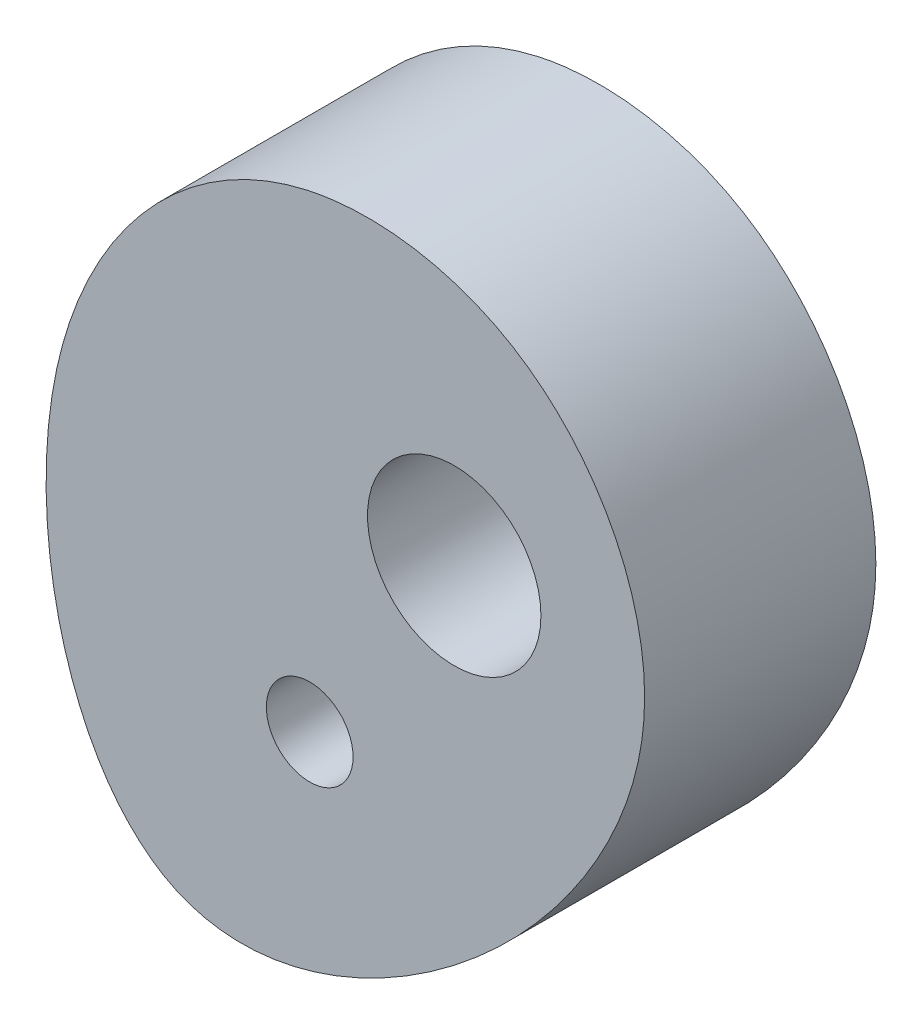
from build123d import *

# Parameters (mm, degrees)
SKETCH1_R          = 3
EXTRUDE1_DEPTH     = 4
SKETCH2_R          = 1.5
CUT_EXTRUDE1_DEPTH = 23.099924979


with BuildPart() as part:
    # Sketch1 → Extrude1 (new, symmetric)
    with BuildSketch(Plane.XY):
        with BuildLine():
            add(Edge.make_bspline(
                [(-5.096384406, 8.70422857), (-2.753221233, 9.223592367), (3.58977037, 8.349173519), (10.814547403, -5.101088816), (-11.03343371, -22.488944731), (-16.346873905, -0.27226663), (-9.336727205, 7.764353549), (-5.096384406, 8.70422857)],
                knots=[0, 0, 0, 0, 0.109458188, 0.265037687, 0.583637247, 0.801917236, 1, 1, 1, 1], degree=3))
        make_face()
        Circle(SKETCH1_R, mode=Mode.SUBTRACT)
    extrude(amount=EXTRUDE1_DEPTH, both=True)

    # Sketch2 → Cut-Extrude1 (cut, through all)
    with BuildSketch(Plane.XY.offset(4)):
        with Locations((-5, -7.483314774)):
            Circle(SKETCH2_R)
    extrude(amount=-CUT_EXTRUDE1_DEPTH, mode=Mode.SUBTRACT)


solid = part.part
